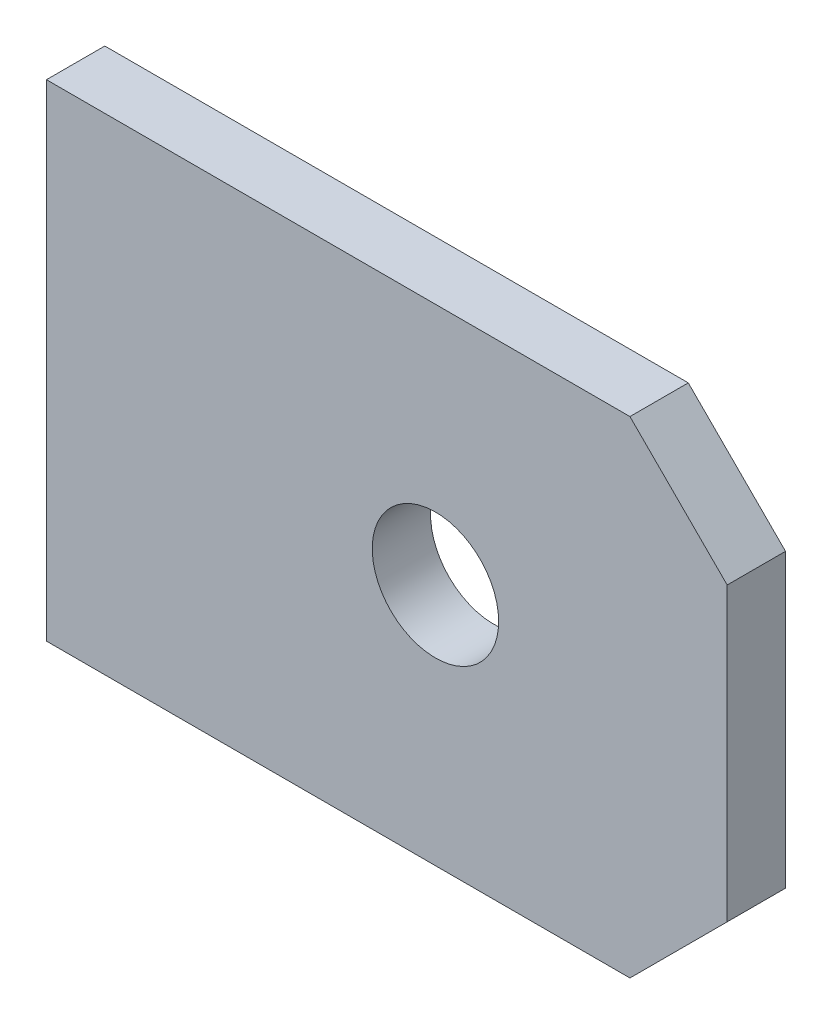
ISO-10303-21;
HEADER;
FILE_DESCRIPTION(('STEP AP214'),'2;1');
FILE_NAME('part.step','',(''),(''),'','','');
FILE_SCHEMA(('AUTOMOTIVE_DESIGN { 1 0 10303 214 1 1 1 1 }'));
ENDSEC;
DATA;
#1=APPLICATION_CONTEXT('core data for automotive mechanical design processes');
#2=APPLICATION_PROTOCOL_DEFINITION('international standard','automotive_design',2000,#1);
#3=PRODUCT_CONTEXT('',#1,'mechanical');
#4=PRODUCT('Part','Part','',(#3));
#5=PRODUCT_RELATED_PRODUCT_CATEGORY('part','',(#4));
#6=PRODUCT_DEFINITION_FORMATION('','',#4);
#7=PRODUCT_DEFINITION_CONTEXT('part definition',#1,'design');
#8=PRODUCT_DEFINITION('design','',#6,#7);
#9=PRODUCT_DEFINITION_SHAPE('','',#8);
#10=(LENGTH_UNIT() NAMED_UNIT(*) SI_UNIT(.MILLI.,.METRE.));
#11=(NAMED_UNIT(*) PLANE_ANGLE_UNIT() SI_UNIT($,.RADIAN.));
#12=(NAMED_UNIT(*) SI_UNIT($,.STERADIAN.) SOLID_ANGLE_UNIT());
#13=UNCERTAINTY_MEASURE_WITH_UNIT(LENGTH_MEASURE(1.E-05),#10,'distance_accuracy_value','');
#14=(GEOMETRIC_REPRESENTATION_CONTEXT(3) GLOBAL_UNCERTAINTY_ASSIGNED_CONTEXT((#13)) GLOBAL_UNIT_ASSIGNED_CONTEXT((#10,
#11,#12)) REPRESENTATION_CONTEXT('',''));
#15=CARTESIAN_POINT('',(0.,0.,0.));
#16=DIRECTION('',(0.,0.,1.));
#17=DIRECTION('',(1.,0.,0.));
#18=AXIS2_PLACEMENT_3D('',#15,#16,#17);
#19=CARTESIAN_POINT('',(0.,0.,12.));
#20=DIRECTION('',(0.,0.,1.));
#21=DIRECTION('',(1.,0.,0.));
#22=AXIS2_PLACEMENT_3D('',#19,#20,#21);
#23=PLANE('',#22);
#24=DIRECTION('',(0.,-1.,0.));
#25=VECTOR('',#24,1.);
#26=CARTESIAN_POINT('',(0.,0.,12.));
#27=LINE('',#26,#25);
#28=CARTESIAN_POINT('',(0.,0.,12.));
#29=VERTEX_POINT('',#28);
#30=CARTESIAN_POINT('',(0.,-100.,12.));
#31=VERTEX_POINT('',#30);
#32=EDGE_CURVE('E119',#29,#31,#27,.T.);
#33=ORIENTED_EDGE('',*,*,#32,.T.);
#34=DIRECTION('',(1.,0.,0.));
#35=VECTOR('',#34,1.);
#36=CARTESIAN_POINT('',(0.,-100.,12.));
#37=LINE('',#36,#35);
#38=CARTESIAN_POINT('',(120.,-100.,12.));
#39=VERTEX_POINT('',#38);
#40=EDGE_CURVE('E100',#31,#39,#37,.T.);
#41=ORIENTED_EDGE('',*,*,#40,.T.);
#42=DIRECTION('',(0.707106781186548,0.707106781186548,0.));
#43=VECTOR('',#42,1.);
#44=CARTESIAN_POINT('',(140.,-80.,12.));
#45=LINE('',#44,#43);
#46=CARTESIAN_POINT('',(140.,-80.,12.));
#47=VERTEX_POINT('',#46);
#48=EDGE_CURVE('E122',#39,#47,#45,.T.);
#49=ORIENTED_EDGE('',*,*,#48,.T.);
#50=DIRECTION('',(0.,1.,0.));
#51=VECTOR('',#50,1.);
#52=CARTESIAN_POINT('',(140.,-20.,12.));
#53=LINE('',#52,#51);
#54=CARTESIAN_POINT('',(140.,-20.,12.));
#55=VERTEX_POINT('',#54);
#56=EDGE_CURVE('E124',#47,#55,#53,.T.);
#57=ORIENTED_EDGE('',*,*,#56,.T.);
#58=DIRECTION('',(-0.707106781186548,0.707106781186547,0.));
#59=VECTOR('',#58,1.);
#60=CARTESIAN_POINT('',(120.,0.,12.));
#61=LINE('',#60,#59);
#62=CARTESIAN_POINT('',(120.,0.,12.));
#63=VERTEX_POINT('',#62);
#64=EDGE_CURVE('E53',#55,#63,#61,.T.);
#65=ORIENTED_EDGE('',*,*,#64,.T.);
#66=DIRECTION('',(-1.,0.,0.));
#67=VECTOR('',#66,1.);
#68=CARTESIAN_POINT('',(0.,0.,12.));
#69=LINE('',#68,#67);
#70=EDGE_CURVE('E48',#63,#29,#69,.T.);
#71=ORIENTED_EDGE('',*,*,#70,.T.);
#72=EDGE_LOOP('',(#33,#41,#49,#57,#65,#71));
#73=FACE_BOUND('',#72,.T.);
#74=CARTESIAN_POINT('',(80.,-50.,12.));
#75=DIRECTION('',(0.,0.,1.));
#76=DIRECTION('',(1.,0.,0.));
#77=AXIS2_PLACEMENT_3D('',#74,#75,#76);
#78=CIRCLE('',#77,13.);
#79=CARTESIAN_POINT('',(93.,-50.,12.));
#80=VERTEX_POINT('',#79);
#81=EDGE_CURVE('E105',#80,#80,#78,.T.);
#82=ORIENTED_EDGE('',*,*,#81,.F.);
#83=EDGE_LOOP('',(#82));
#84=FACE_BOUND('',#83,.T.);
#85=ADVANCED_FACE('F33',(#73,#84),#23,.T.);
#86=CARTESIAN_POINT('',(0.,0.,0.));
#87=DIRECTION('',(0.,0.,1.));
#88=DIRECTION('',(1.,0.,0.));
#89=AXIS2_PLACEMENT_3D('',#86,#87,#88);
#90=PLANE('',#89);
#91=DIRECTION('',(0.,-1.,0.));
#92=VECTOR('',#91,1.);
#93=CARTESIAN_POINT('',(0.,0.,0.));
#94=LINE('',#93,#92);
#95=CARTESIAN_POINT('',(0.,0.,0.));
#96=VERTEX_POINT('',#95);
#97=CARTESIAN_POINT('',(0.,-100.,0.));
#98=VERTEX_POINT('',#97);
#99=EDGE_CURVE('E91',#96,#98,#94,.T.);
#100=ORIENTED_EDGE('',*,*,#99,.F.);
#101=DIRECTION('',(-1.,0.,0.));
#102=VECTOR('',#101,1.);
#103=CARTESIAN_POINT('',(0.,0.,0.));
#104=LINE('',#103,#102);
#105=CARTESIAN_POINT('',(120.,0.,0.));
#106=VERTEX_POINT('',#105);
#107=EDGE_CURVE('E117',#106,#96,#104,.T.);
#108=ORIENTED_EDGE('',*,*,#107,.F.);
#109=DIRECTION('',(-0.707106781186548,0.707106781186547,0.));
#110=VECTOR('',#109,1.);
#111=CARTESIAN_POINT('',(120.,0.,0.));
#112=LINE('',#111,#110);
#113=CARTESIAN_POINT('',(140.,-20.,0.));
#114=VERTEX_POINT('',#113);
#115=EDGE_CURVE('E115',#114,#106,#112,.T.);
#116=ORIENTED_EDGE('',*,*,#115,.F.);
#117=DIRECTION('',(0.,1.,0.));
#118=VECTOR('',#117,1.);
#119=CARTESIAN_POINT('',(140.,-20.,0.));
#120=LINE('',#119,#118);
#121=CARTESIAN_POINT('',(140.,-80.,0.));
#122=VERTEX_POINT('',#121);
#123=EDGE_CURVE('E113',#122,#114,#120,.T.);
#124=ORIENTED_EDGE('',*,*,#123,.F.);
#125=DIRECTION('',(0.707106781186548,0.707106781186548,0.));
#126=VECTOR('',#125,1.);
#127=CARTESIAN_POINT('',(140.,-80.,0.));
#128=LINE('',#127,#126);
#129=CARTESIAN_POINT('',(120.,-100.,0.));
#130=VERTEX_POINT('',#129);
#131=EDGE_CURVE('E93',#130,#122,#128,.T.);
#132=ORIENTED_EDGE('',*,*,#131,.F.);
#133=DIRECTION('',(1.,0.,0.));
#134=VECTOR('',#133,1.);
#135=CARTESIAN_POINT('',(0.,-100.,0.));
#136=LINE('',#135,#134);
#137=EDGE_CURVE('E86',#98,#130,#136,.T.);
#138=ORIENTED_EDGE('',*,*,#137,.F.);
#139=EDGE_LOOP('',(#100,#108,#116,#124,#132,#138));
#140=FACE_BOUND('',#139,.T.);
#141=CARTESIAN_POINT('',(80.,-50.,0.));
#142=DIRECTION('',(0.,0.,1.));
#143=DIRECTION('',(1.,0.,0.));
#144=AXIS2_PLACEMENT_3D('',#141,#142,#143);
#145=CIRCLE('',#144,13.);
#146=CARTESIAN_POINT('',(93.,-50.,0.));
#147=VERTEX_POINT('',#146);
#148=EDGE_CURVE('E108',#147,#147,#145,.T.);
#149=ORIENTED_EDGE('',*,*,#148,.T.);
#150=EDGE_LOOP('',(#149));
#151=FACE_BOUND('',#150,.T.);
#152=ADVANCED_FACE('F87',(#140,#151),#90,.F.);
#153=CARTESIAN_POINT('',(0.,0.,12.));
#154=DIRECTION('',(1.,0.,0.));
#155=DIRECTION('',(0.,1.,0.));
#156=AXIS2_PLACEMENT_3D('',#153,#154,#155);
#157=PLANE('',#156);
#158=ORIENTED_EDGE('',*,*,#99,.T.);
#159=DIRECTION('',(0.,0.,-1.));
#160=VECTOR('',#159,1.);
#161=CARTESIAN_POINT('',(0.,-100.,12.));
#162=LINE('',#161,#160);
#163=EDGE_CURVE('E11',#31,#98,#162,.T.);
#164=ORIENTED_EDGE('',*,*,#163,.F.);
#165=ORIENTED_EDGE('',*,*,#32,.F.);
#166=DIRECTION('',(0.,0.,-1.));
#167=VECTOR('',#166,1.);
#168=CARTESIAN_POINT('',(0.,0.,12.));
#169=LINE('',#168,#167);
#170=EDGE_CURVE('E104',#29,#96,#169,.T.);
#171=ORIENTED_EDGE('',*,*,#170,.T.);
#172=EDGE_LOOP('',(#158,#164,#165,#171));
#173=FACE_BOUND('',#172,.T.);
#174=ADVANCED_FACE('F35',(#173),#157,.F.);
#175=CARTESIAN_POINT('',(0.,-100.,12.));
#176=DIRECTION('',(0.,1.,0.));
#177=DIRECTION('',(0.,0.,1.));
#178=AXIS2_PLACEMENT_3D('',#175,#176,#177);
#179=PLANE('',#178);
#180=ORIENTED_EDGE('',*,*,#137,.T.);
#181=DIRECTION('',(0.,0.,-1.));
#182=VECTOR('',#181,1.);
#183=CARTESIAN_POINT('',(120.,-100.,12.));
#184=LINE('',#183,#182);
#185=EDGE_CURVE('E41',#39,#130,#184,.T.);
#186=ORIENTED_EDGE('',*,*,#185,.F.);
#187=ORIENTED_EDGE('',*,*,#40,.F.);
#188=ORIENTED_EDGE('',*,*,#163,.T.);
#189=EDGE_LOOP('',(#180,#186,#187,#188));
#190=FACE_BOUND('',#189,.T.);
#191=ADVANCED_FACE('F99',(#190),#179,.F.);
#192=CARTESIAN_POINT('',(140.,-80.,12.));
#193=DIRECTION('',(-0.707106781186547,0.707106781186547,0.));
#194=DIRECTION('',(-0.707106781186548,-0.707106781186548,0.));
#195=AXIS2_PLACEMENT_3D('',#192,#193,#194);
#196=PLANE('',#195);
#197=ORIENTED_EDGE('',*,*,#131,.T.);
#198=DIRECTION('',(0.,0.,-1.));
#199=VECTOR('',#198,1.);
#200=CARTESIAN_POINT('',(140.,-80.,12.));
#201=LINE('',#200,#199);
#202=EDGE_CURVE('E135',#47,#122,#201,.T.);
#203=ORIENTED_EDGE('',*,*,#202,.F.);
#204=ORIENTED_EDGE('',*,*,#48,.F.);
#205=ORIENTED_EDGE('',*,*,#185,.T.);
#206=EDGE_LOOP('',(#197,#203,#204,#205));
#207=FACE_BOUND('',#206,.T.);
#208=ADVANCED_FACE('F139',(#207),#196,.F.);
#209=CARTESIAN_POINT('',(140.,-20.,12.));
#210=DIRECTION('',(-1.,0.,0.));
#211=DIRECTION('',(0.,0.,1.));
#212=AXIS2_PLACEMENT_3D('',#209,#210,#211);
#213=PLANE('',#212);
#214=ORIENTED_EDGE('',*,*,#123,.T.);
#215=DIRECTION('',(0.,0.,-1.));
#216=VECTOR('',#215,1.);
#217=CARTESIAN_POINT('',(140.,-20.,12.));
#218=LINE('',#217,#216);
#219=EDGE_CURVE('E132',#55,#114,#218,.T.);
#220=ORIENTED_EDGE('',*,*,#219,.F.);
#221=ORIENTED_EDGE('',*,*,#56,.F.);
#222=ORIENTED_EDGE('',*,*,#202,.T.);
#223=EDGE_LOOP('',(#214,#220,#221,#222));
#224=FACE_BOUND('',#223,.T.);
#225=ADVANCED_FACE('F145',(#224),#213,.F.);
#226=CARTESIAN_POINT('',(120.,0.,12.));
#227=DIRECTION('',(-0.707106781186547,-0.707106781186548,0.));
#228=DIRECTION('',(0.707106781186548,-0.707106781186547,0.));
#229=AXIS2_PLACEMENT_3D('',#226,#227,#228);
#230=PLANE('',#229);
#231=ORIENTED_EDGE('',*,*,#115,.T.);
#232=DIRECTION('',(0.,0.,-1.));
#233=VECTOR('',#232,1.);
#234=CARTESIAN_POINT('',(120.,0.,12.));
#235=LINE('',#234,#233);
#236=EDGE_CURVE('E129',#63,#106,#235,.T.);
#237=ORIENTED_EDGE('',*,*,#236,.F.);
#238=ORIENTED_EDGE('',*,*,#64,.F.);
#239=ORIENTED_EDGE('',*,*,#219,.T.);
#240=EDGE_LOOP('',(#231,#237,#238,#239));
#241=FACE_BOUND('',#240,.T.);
#242=ADVANCED_FACE('F148',(#241),#230,.F.);
#243=CARTESIAN_POINT('',(0.,0.,12.));
#244=DIRECTION('',(0.,-1.,0.));
#245=DIRECTION('',(0.,0.,-1.));
#246=AXIS2_PLACEMENT_3D('',#243,#244,#245);
#247=PLANE('',#246);
#248=ORIENTED_EDGE('',*,*,#107,.T.);
#249=ORIENTED_EDGE('',*,*,#170,.F.);
#250=ORIENTED_EDGE('',*,*,#70,.F.);
#251=ORIENTED_EDGE('',*,*,#236,.T.);
#252=EDGE_LOOP('',(#248,#249,#250,#251));
#253=FACE_BOUND('',#252,.T.);
#254=ADVANCED_FACE('F150',(#253),#247,.F.);
#255=CARTESIAN_POINT('',(80.,-50.,12.));
#256=DIRECTION('',(0.,0.,-1.));
#257=DIRECTION('',(-1.,0.,0.));
#258=AXIS2_PLACEMENT_3D('',#255,#256,#257);
#259=CYLINDRICAL_SURFACE('',#258,13.);
#260=ORIENTED_EDGE('',*,*,#81,.T.);
#261=EDGE_LOOP('',(#260));
#262=FACE_BOUND('',#261,.T.);
#263=ORIENTED_EDGE('',*,*,#148,.F.);
#264=EDGE_LOOP('',(#263));
#265=FACE_BOUND('',#264,.T.);
#266=ADVANCED_FACE('F152',(#262,#265),#259,.F.);
#267=CLOSED_SHELL('',(#85,#152,#174,#191,#208,#225,#242,#254,#266));
#268=MANIFOLD_SOLID_BREP('B2',#267);
#269=ADVANCED_BREP_SHAPE_REPRESENTATION('',(#18,#268),#14);
#270=SHAPE_DEFINITION_REPRESENTATION(#9,#269);
ENDSEC;
END-ISO-10303-21;
